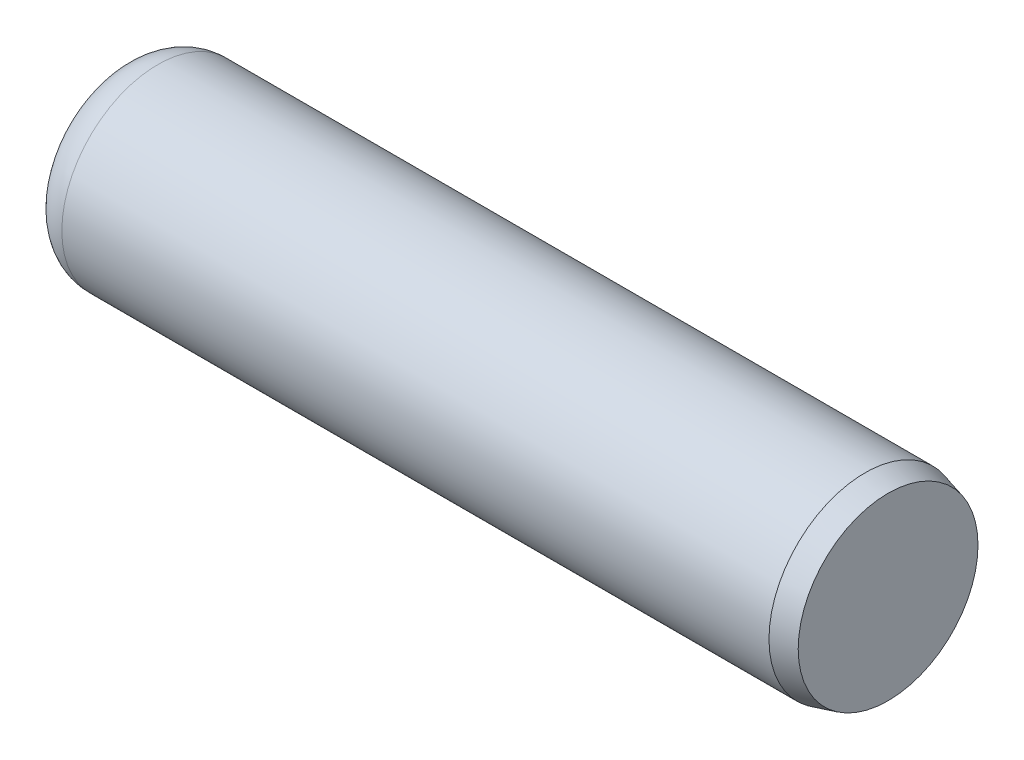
from build123d import *


with BuildPart() as part:
    # Sketch1 → Base-Revolve (revolve)
    with BuildSketch(Plane.XY, mode=Mode.PRIVATE) as base_revolve_sk:
        with BuildLine():
            Line((0, 0), (101.6, 0))
            Line((101.6, 0), (101.6, 11.883290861))
            Line((101.6, 11.883290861), (98.552, 12.7))
            Line((98.552, 12.7), (5.08, 12.7))
            ThreePointArc((5.08, 12.7), (1.487897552, 11.212102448), (0, 7.62))
            Line((0, 7.62), (0, 0))
        make_face()
    revolve(base_revolve_sk.sketch.rotate(Axis((-6.35, 0, 0), (1, 0, 0)), 90), axis=Axis((-6.35, 0, 0), (1, 0, 0)))


solid = part.part
